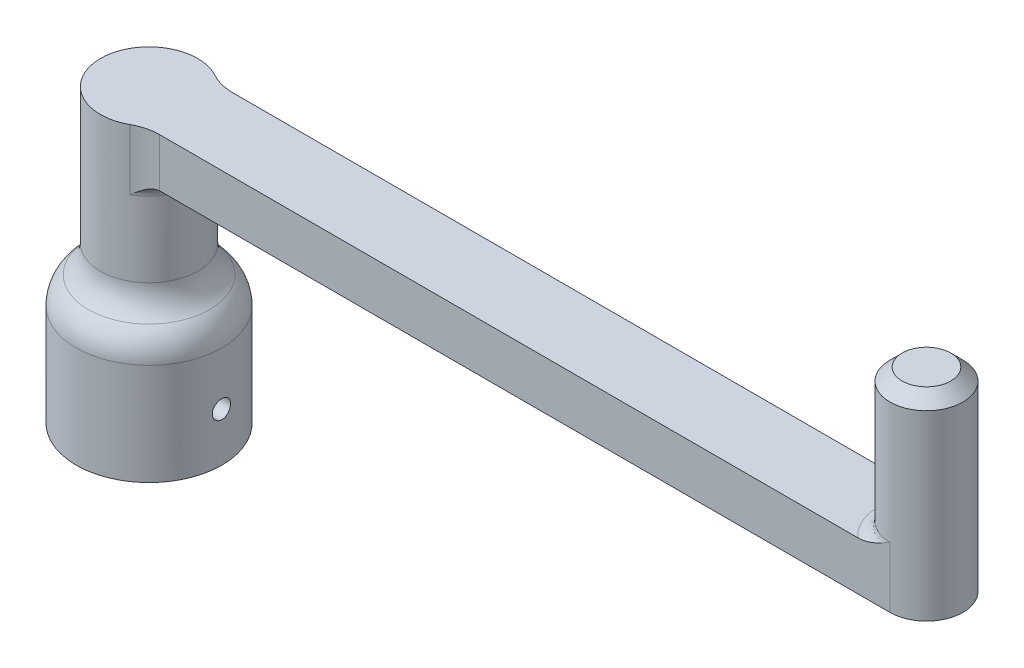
ISO-10303-21;
HEADER;
FILE_DESCRIPTION(('STEP AP214'),'2;1');
FILE_NAME('part.step','',(''),(''),'','','');
FILE_SCHEMA(('AUTOMOTIVE_DESIGN { 1 0 10303 214 1 1 1 1 }'));
ENDSEC;
DATA;
#1=APPLICATION_CONTEXT('core data for automotive mechanical design processes');
#2=APPLICATION_PROTOCOL_DEFINITION('international standard','automotive_design',2000,#1);
#3=PRODUCT_CONTEXT('',#1,'mechanical');
#4=PRODUCT('Part','Part','',(#3));
#5=PRODUCT_RELATED_PRODUCT_CATEGORY('part','',(#4));
#6=PRODUCT_DEFINITION_FORMATION('','',#4);
#7=PRODUCT_DEFINITION_CONTEXT('part definition',#1,'design');
#8=PRODUCT_DEFINITION('design','',#6,#7);
#9=PRODUCT_DEFINITION_SHAPE('','',#8);
#10=(LENGTH_UNIT() NAMED_UNIT(*) SI_UNIT(.MILLI.,.METRE.));
#11=(NAMED_UNIT(*) PLANE_ANGLE_UNIT() SI_UNIT($,.RADIAN.));
#12=(NAMED_UNIT(*) SI_UNIT($,.STERADIAN.) SOLID_ANGLE_UNIT());
#13=UNCERTAINTY_MEASURE_WITH_UNIT(LENGTH_MEASURE(1.E-05),#10,'distance_accuracy_value','');
#14=(GEOMETRIC_REPRESENTATION_CONTEXT(3) GLOBAL_UNCERTAINTY_ASSIGNED_CONTEXT((#13)) GLOBAL_UNIT_ASSIGNED_CONTEXT((#10,
#11,#12)) REPRESENTATION_CONTEXT('',''));
#15=CARTESIAN_POINT('',(0.,0.,0.));
#16=DIRECTION('',(0.,0.,1.));
#17=DIRECTION('',(1.,0.,0.));
#18=AXIS2_PLACEMENT_3D('',#15,#16,#17);
#19=CARTESIAN_POINT('',(0.,38.1,0.));
#20=DIRECTION('',(0.,-1.,0.));
#21=DIRECTION('',(0.,0.,-1.));
#22=AXIS2_PLACEMENT_3D('',#19,#20,#21);
#23=CYLINDRICAL_SURFACE('',#22,6.35);
#24=CARTESIAN_POINT('',(0.,20.3651280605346,0.));
#25=DIRECTION('',(0.,-1.,0.));
#26=DIRECTION('',(0.,0.,-1.));
#27=AXIS2_PLACEMENT_3D('',#24,#25,#26);
#28=CIRCLE('',#27,6.35);
#29=CARTESIAN_POINT('',(0.,20.3651280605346,-6.35));
#30=VERTEX_POINT('',#29);
#31=EDGE_CURVE('E314',#30,#30,#28,.F.);
#32=ORIENTED_EDGE('',*,*,#31,.T.);
#33=EDGE_LOOP('',(#32));
#34=FACE_BOUND('',#33,.T.);
#35=DIRECTION('',(0.,-1.,0.));
#36=VECTOR('',#35,1.);
#37=CARTESIAN_POINT('',(3.07418053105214,38.1,-5.55625));
#38=LINE('',#37,#36);
#39=CARTESIAN_POINT('',(3.07418053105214,38.1,-5.55625));
#40=VERTEX_POINT('',#39);
#41=CARTESIAN_POINT('',(3.07418053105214,30.1625,-5.55625));
#42=VERTEX_POINT('',#41);
#43=EDGE_CURVE('E305',#40,#42,#38,.T.);
#44=ORIENTED_EDGE('',*,*,#43,.T.);
#45=CARTESIAN_POINT('',(0.,30.1625,0.));
#46=DIRECTION('',(0.,1.,0.));
#47=DIRECTION('',(0.,0.,1.));
#48=AXIS2_PLACEMENT_3D('',#45,#46,#47);
#49=CIRCLE('',#48,6.35);
#50=CARTESIAN_POINT('',(3.07418053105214,30.1625,5.55625));
#51=VERTEX_POINT('',#50);
#52=EDGE_CURVE('E277',#42,#51,#49,.F.);
#53=ORIENTED_EDGE('',*,*,#52,.T.);
#54=DIRECTION('',(0.,-1.,0.));
#55=VECTOR('',#54,1.);
#56=CARTESIAN_POINT('',(3.07418053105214,38.1,5.55625));
#57=LINE('',#56,#55);
#58=CARTESIAN_POINT('',(3.07418053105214,38.1,5.55625));
#59=VERTEX_POINT('',#58);
#60=EDGE_CURVE('E303',#51,#59,#57,.F.);
#61=ORIENTED_EDGE('',*,*,#60,.T.);
#62=CARTESIAN_POINT('',(0.,38.1,0.));
#63=DIRECTION('',(0.,1.,0.));
#64=DIRECTION('',(0.,0.,1.));
#65=AXIS2_PLACEMENT_3D('',#62,#63,#64);
#66=CIRCLE('',#65,6.35);
#67=EDGE_CURVE('E316',#40,#59,#66,.T.);
#68=ORIENTED_EDGE('',*,*,#67,.F.);
#69=EDGE_LOOP('',(#44,#53,#61,#68));
#70=FACE_BOUND('',#69,.T.);
#71=ADVANCED_FACE('F34',(#34,#70),#23,.T.);
#72=CARTESIAN_POINT('',(0.,0.,0.));
#73=DIRECTION('',(0.,1.,0.));
#74=DIRECTION('',(0.,0.,1.));
#75=AXIS2_PLACEMENT_3D('',#72,#73,#74);
#76=PLANE('',#75);
#77=CARTESIAN_POINT('',(0.,0.,0.));
#78=DIRECTION('',(0.,1.,0.));
#79=DIRECTION('',(0.,0.,1.));
#80=AXIS2_PLACEMENT_3D('',#77,#78,#79);
#81=CIRCLE('',#80,9.525);
#82=CARTESIAN_POINT('',(0.,0.,9.525));
#83=VERTEX_POINT('',#82);
#84=EDGE_CURVE('E318',#83,#83,#81,.T.);
#85=ORIENTED_EDGE('',*,*,#84,.F.);
#86=EDGE_LOOP('',(#85));
#87=FACE_BOUND('',#86,.T.);
#88=CARTESIAN_POINT('',(0.,0.,0.));
#89=DIRECTION('',(0.,1.,0.));
#90=DIRECTION('',(0.,0.,1.));
#91=AXIS2_PLACEMENT_3D('',#88,#89,#90);
#92=CIRCLE('',#91,6.35);
#93=CARTESIAN_POINT('',(4.7625,0.,-4.20013020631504));
#94=VERTEX_POINT('',#93);
#95=CARTESIAN_POINT('',(4.7625,0.,4.20013020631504));
#96=VERTEX_POINT('',#95);
#97=EDGE_CURVE('E158',#94,#96,#92,.T.);
#98=ORIENTED_EDGE('',*,*,#97,.T.);
#99=DIRECTION('',(0.,0.,-1.));
#100=VECTOR('',#99,1.);
#101=CARTESIAN_POINT('',(4.7625,0.,4.20013020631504));
#102=LINE('',#101,#100);
#103=EDGE_CURVE('E328',#96,#94,#102,.T.);
#104=ORIENTED_EDGE('',*,*,#103,.T.);
#105=EDGE_LOOP('',(#98,#104));
#106=FACE_BOUND('',#105,.T.);
#107=ADVANCED_FACE('F191',(#87,#106),#76,.F.);
#108=CARTESIAN_POINT('',(0.,38.1,0.));
#109=DIRECTION('',(0.,1.,0.));
#110=DIRECTION('',(0.,0.,1.));
#111=AXIS2_PLACEMENT_3D('',#108,#109,#110);
#112=PLANE('',#111);
#113=DIRECTION('',(1.,0.,0.));
#114=VECTOR('',#113,1.);
#115=CARTESIAN_POINT('',(0.,38.1,4.7625));
#116=LINE('',#115,#114);
#117=CARTESIAN_POINT('',(6.14836106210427,38.1,4.7625));
#118=VERTEX_POINT('',#117);
#119=CARTESIAN_POINT('',(97.3998697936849,38.1,4.76250000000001));
#120=VERTEX_POINT('',#119);
#121=EDGE_CURVE('E128',#118,#120,#116,.T.);
#122=ORIENTED_EDGE('',*,*,#121,.T.);
#123=CARTESIAN_POINT('',(101.6,38.1,0.));
#124=DIRECTION('',(0.,1.,0.));
#125=DIRECTION('',(0.,0.,1.));
#126=AXIS2_PLACEMENT_3D('',#123,#124,#125);
#127=CIRCLE('',#126,6.35);
#128=CARTESIAN_POINT('',(97.3998697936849,38.1,-4.76249999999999));
#129=VERTEX_POINT('',#128);
#130=EDGE_CURVE('E275',#120,#129,#127,.F.);
#131=ORIENTED_EDGE('',*,*,#130,.T.);
#132=DIRECTION('',(1.,0.,0.));
#133=VECTOR('',#132,1.);
#134=CARTESIAN_POINT('',(0.,38.1,-4.7625));
#135=LINE('',#134,#133);
#136=CARTESIAN_POINT('',(6.14836106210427,38.1,-4.7625));
#137=VERTEX_POINT('',#136);
#138=EDGE_CURVE('E289',#137,#129,#135,.T.);
#139=ORIENTED_EDGE('',*,*,#138,.F.);
#140=CARTESIAN_POINT('',(6.14836106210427,38.1,-11.1125));
#141=DIRECTION('',(0.,1.,0.));
#142=DIRECTION('',(0.,0.,1.));
#143=AXIS2_PLACEMENT_3D('',#140,#141,#142);
#144=CIRCLE('',#143,6.35);
#145=EDGE_CURVE('E265',#137,#40,#144,.F.);
#146=ORIENTED_EDGE('',*,*,#145,.T.);
#147=ORIENTED_EDGE('',*,*,#67,.T.);
#148=CARTESIAN_POINT('',(6.14836106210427,38.1,11.1125));
#149=DIRECTION('',(0.,1.,0.));
#150=DIRECTION('',(0.,0.,1.));
#151=AXIS2_PLACEMENT_3D('',#148,#149,#150);
#152=CIRCLE('',#151,6.35);
#153=EDGE_CURVE('E269',#59,#118,#152,.F.);
#154=ORIENTED_EDGE('',*,*,#153,.T.);
#155=EDGE_LOOP('',(#122,#131,#139,#146,#147,#154));
#156=FACE_BOUND('',#155,.T.);
#157=ADVANCED_FACE('F188',(#156),#112,.T.);
#158=CARTESIAN_POINT('',(0.,15.875,0.));
#159=DIRECTION('',(0.,-1.,0.));
#160=DIRECTION('',(0.,0.,-1.));
#161=AXIS2_PLACEMENT_3D('',#158,#159,#160);
#162=CYLINDRICAL_SURFACE('',#161,9.525);
#163=CARTESIAN_POINT('',(9.525,5.159375,0.));
#164=CARTESIAN_POINT('',(9.52499907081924,5.15937782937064,0.0665993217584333));
#165=CARTESIAN_POINT('',(9.52429412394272,5.16498183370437,0.133240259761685));
#166=CARTESIAN_POINT('',(9.52154975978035,5.18724884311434,0.264667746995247));
#167=CARTESIAN_POINT('',(9.51950894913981,5.20392339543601,0.32945228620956));
#168=CARTESIAN_POINT('',(9.51432276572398,5.24783255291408,0.455245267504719));
#169=CARTESIAN_POINT('',(9.51117813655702,5.27506005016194,0.5162562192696));
#170=CARTESIAN_POINT('',(9.50413406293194,5.33928666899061,0.63283122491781));
#171=CARTESIAN_POINT('',(9.5002347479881,5.37628411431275,0.688396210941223));
#172=CARTESIAN_POINT('',(9.49209265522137,5.4592181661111,0.792819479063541));
#173=CARTESIAN_POINT('',(9.48784828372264,5.50519780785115,0.841643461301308));
#174=CARTESIAN_POINT('',(9.47950729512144,5.60469866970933,0.930903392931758));
#175=CARTESIAN_POINT('',(9.47541068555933,5.65822027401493,0.971338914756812));
#176=CARTESIAN_POINT('',(9.46781335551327,5.77150863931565,1.04280183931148));
#177=CARTESIAN_POINT('',(9.4643146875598,5.83129581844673,1.07379711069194));
#178=CARTESIAN_POINT('',(9.45833037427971,5.95527783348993,1.1252944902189));
#179=CARTESIAN_POINT('',(9.45584469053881,6.01947250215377,1.14579699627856));
#180=CARTESIAN_POINT('',(9.45218299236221,6.1500912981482,1.1756226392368));
#181=CARTESIAN_POINT('',(9.45100019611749,6.21650200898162,1.18500368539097));
#182=CARTESIAN_POINT('',(9.45005743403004,6.34996488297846,1.19249930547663));
#183=CARTESIAN_POINT('',(9.45029741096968,6.41701702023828,1.1906143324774));
#184=CARTESIAN_POINT('',(9.45216687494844,6.54945579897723,1.17567895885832));
#185=CARTESIAN_POINT('',(9.45378842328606,6.61484976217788,1.16269234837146));
#186=CARTESIAN_POINT('',(9.45822593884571,6.74252287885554,1.12602186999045));
#187=CARTESIAN_POINT('',(9.46104193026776,6.80480196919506,1.10233778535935));
#188=CARTESIAN_POINT('',(9.4675600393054,6.92467563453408,1.04487609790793));
#189=CARTESIAN_POINT('',(9.4712645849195,6.98225678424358,1.01107077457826));
#190=CARTESIAN_POINT('',(9.47914051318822,7.09095293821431,0.93434604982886));
#191=CARTESIAN_POINT('',(9.48331191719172,7.14206764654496,0.891426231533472));
#192=CARTESIAN_POINT('',(9.49168683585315,7.23675021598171,0.79733732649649));
#193=CARTESIAN_POINT('',(9.49589037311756,7.28026345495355,0.746113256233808));
#194=CARTESIAN_POINT('',(9.50382893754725,7.35808260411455,0.637059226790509));
#195=CARTESIAN_POINT('',(9.50756396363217,7.39238849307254,0.57922925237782));
#196=CARTESIAN_POINT('',(9.51414698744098,7.45081916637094,0.458562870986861));
#197=CARTESIAN_POINT('',(9.51699468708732,7.47494053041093,0.39572479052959));
#198=CARTESIAN_POINT('',(9.52147949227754,7.51227407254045,0.266846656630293));
#199=CARTESIAN_POINT('',(9.52311665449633,7.52548676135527,0.200806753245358));
#200=CARTESIAN_POINT('',(9.52498855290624,7.54055709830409,0.0678718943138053));
#201=CARTESIAN_POINT('',(9.5252325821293,7.54248999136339,0.000985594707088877));
#202=CARTESIAN_POINT('',(9.52431580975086,7.53514444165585,-0.13215748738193));
#203=CARTESIAN_POINT('',(9.52315503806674,7.52586623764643,-0.198414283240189));
#204=CARTESIAN_POINT('',(9.51956488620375,7.4964243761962,-0.328195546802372));
#205=CARTESIAN_POINT('',(9.51713968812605,7.4762965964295,-0.391728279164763));
#206=CARTESIAN_POINT('',(9.51129220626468,7.42576423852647,-0.514516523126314));
#207=CARTESIAN_POINT('',(9.50786988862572,7.39535931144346,-0.573771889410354));
#208=CARTESIAN_POINT('',(9.50038655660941,7.32495369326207,-0.686659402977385));
#209=CARTESIAN_POINT('',(9.49632233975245,7.28490432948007,-0.740260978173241));
#210=CARTESIAN_POINT('',(9.48801986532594,7.19641555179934,-0.840008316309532));
#211=CARTESIAN_POINT('',(9.4837816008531,7.14797580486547,-0.886153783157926));
#212=CARTESIAN_POINT('',(9.47558003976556,7.04374984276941,-0.969945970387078));
#213=CARTESIAN_POINT('',(9.47161844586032,6.98792337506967,-1.00754281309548));
#214=CARTESIAN_POINT('',(9.46444677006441,6.87070401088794,-1.07282593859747));
#215=CARTESIAN_POINT('',(9.46123667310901,6.80931122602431,-1.10051242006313));
#216=CARTESIAN_POINT('',(9.45594303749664,6.68286287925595,-1.14510815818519));
#217=CARTESIAN_POINT('',(9.45385656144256,6.61781736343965,-1.16204553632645));
#218=CARTESIAN_POINT('',(9.45103797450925,6.48577769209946,-1.18475283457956));
#219=CARTESIAN_POINT('',(9.4503058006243,6.41878362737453,-1.19052327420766));
#220=CARTESIAN_POINT('',(9.45028055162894,6.28524479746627,-1.1907233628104));
#221=CARTESIAN_POINT('',(9.45097753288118,6.21870013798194,-1.18523137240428));
#222=CARTESIAN_POINT('',(9.45371068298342,6.08748760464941,-1.16322843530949));
#223=CARTESIAN_POINT('',(9.45574685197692,6.02281973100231,-1.14671748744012));
#224=CARTESIAN_POINT('',(9.46092587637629,5.89720676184,-1.1031698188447));
#225=CARTESIAN_POINT('',(9.46406833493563,5.83626034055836,-1.07613687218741));
#226=CARTESIAN_POINT('',(9.47110651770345,5.71975615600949,-1.01232028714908));
#227=CARTESIAN_POINT('',(9.47500225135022,5.66419846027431,-0.97553652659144));
#228=CARTESIAN_POINT('',(9.48314050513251,5.5596482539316,-0.892971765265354));
#229=CARTESIAN_POINT('',(9.48738516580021,5.51070202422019,-0.847132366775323));
#230=CARTESIAN_POINT('',(9.49572411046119,5.42116637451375,-0.747879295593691));
#231=CARTESIAN_POINT('',(9.49981835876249,5.38057892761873,-0.69446383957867));
#232=CARTESIAN_POINT('',(9.50741235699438,5.3087815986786,-0.581342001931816));
#233=CARTESIAN_POINT('',(9.51090978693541,5.27760796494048,-0.521612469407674));
#234=CARTESIAN_POINT('',(9.5168925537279,5.22577794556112,-0.397755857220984));
#235=CARTESIAN_POINT('',(9.5193789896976,5.20511013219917,-0.333633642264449));
#236=CARTESIAN_POINT('',(9.52246025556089,5.17982549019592,-0.224316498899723));
#237=CARTESIAN_POINT('',(9.5234080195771,5.17216757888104,-0.179810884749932));
#238=CARTESIAN_POINT('',(9.52467820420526,5.1619413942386,-0.0902098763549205));
#239=CARTESIAN_POINT('',(9.52500062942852,5.15937308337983,-0.0451144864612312));
#240=CARTESIAN_POINT('',(9.525,5.159375,0.));
#241=B_SPLINE_CURVE_WITH_KNOTS('',3,(#163,#164,#165,#166,#167,#168,#169,#170,#171,#172,#173,
#174,#175,#176,#177,#178,#179,#180,#181,#182,#183,#184,#185,#186,#187,#188,#189,#190,#191,#192,
#193,#194,#195,#196,#197,#198,#199,#200,#201,#202,#203,#204,#205,#206,#207,#208,#209,#210,#211,
#212,#213,#214,#215,#216,#217,#218,#219,#220,#221,#222,#223,#224,#225,#226,#227,#228,#229,#230,
#231,#232,#233,#234,#235,#236,#237,#238,#239,#240),.UNSPECIFIED.,.T.,.F.,(4,2,2,2,2,2,2,2,2,2,2,
2,2,2,2,2,2,2,2,2,2,2,2,2,2,2,2,2,2,2,2,2,2,2,2,2,2,2,4),(0.,0.199633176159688,
0.399474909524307,0.599182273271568,0.798855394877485,0.999509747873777,1.20017432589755,
1.40151445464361,1.60284694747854,1.8031264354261,2.00339786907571,2.20252621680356,
2.40165859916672,2.60134144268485,2.8010334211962,3.00210606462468,3.2031791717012,
3.40431975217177,3.60545091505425,3.80523883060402,4.00502249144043,4.2041495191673,
4.40328330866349,4.60344394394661,4.80361252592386,5.00492063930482,5.20622471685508,
5.4069999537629,5.60776584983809,5.80713961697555,6.00651340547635,6.20581574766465,
6.40512058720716,6.60575531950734,6.80643735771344,7.00788255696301,7.20910816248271,
7.34434099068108,7.47957282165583),.UNSPECIFIED.);
#242=CARTESIAN_POINT('',(9.525,5.159375,0.));
#243=VERTEX_POINT('',#242);
#244=EDGE_CURVE('E150',#243,#243,#241,.T.);
#245=ORIENTED_EDGE('',*,*,#244,.T.);
#246=EDGE_LOOP('',(#245));
#247=FACE_BOUND('',#246,.T.);
#248=CARTESIAN_POINT('',(0.,13.2656122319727,0.));
#249=DIRECTION('',(0.,-1.,0.));
#250=DIRECTION('',(0.,0.,-1.));
#251=AXIS2_PLACEMENT_3D('',#248,#249,#250);
#252=CIRCLE('',#251,9.525);
#253=CARTESIAN_POINT('',(0.,13.2656122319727,-9.525));
#254=VERTEX_POINT('',#253);
#255=EDGE_CURVE('E307',#254,#254,#252,.T.);
#256=ORIENTED_EDGE('',*,*,#255,.T.);
#257=EDGE_LOOP('',(#256));
#258=FACE_BOUND('',#257,.T.);
#259=ORIENTED_EDGE('',*,*,#84,.T.);
#260=EDGE_LOOP('',(#259));
#261=FACE_BOUND('',#260,.T.);
#262=ADVANCED_FACE('F161',(#247,#258,#261),#162,.T.);
#263=CARTESIAN_POINT('',(0.,12.7,0.));
#264=DIRECTION('',(0.,-1.,0.));
#265=DIRECTION('',(0.,0.,-1.));
#266=AXIS2_PLACEMENT_3D('',#263,#264,#265);
#267=CYLINDRICAL_SURFACE('',#266,6.35);
#268=ORIENTED_EDGE('',*,*,#97,.F.);
#269=DIRECTION('',(0.,-1.,0.));
#270=VECTOR('',#269,1.);
#271=CARTESIAN_POINT('',(4.7625,12.7,-4.20013020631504));
#272=LINE('',#271,#270);
#273=CARTESIAN_POINT('',(4.7625,12.7,-4.20013020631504));
#274=VERTEX_POINT('',#273);
#275=EDGE_CURVE('E324',#274,#94,#272,.T.);
#276=ORIENTED_EDGE('',*,*,#275,.F.);
#277=CARTESIAN_POINT('',(0.,12.7,0.));
#278=DIRECTION('',(0.,1.,0.));
#279=DIRECTION('',(0.,0.,1.));
#280=AXIS2_PLACEMENT_3D('',#277,#278,#279);
#281=CIRCLE('',#280,6.35);
#282=CARTESIAN_POINT('',(4.7625,12.7,4.20013020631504));
#283=VERTEX_POINT('',#282);
#284=EDGE_CURVE('E159',#274,#283,#281,.T.);
#285=ORIENTED_EDGE('',*,*,#284,.T.);
#286=DIRECTION('',(0.,-1.,0.));
#287=VECTOR('',#286,1.);
#288=CARTESIAN_POINT('',(4.7625,12.7,4.20013020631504));
#289=LINE('',#288,#287);
#290=EDGE_CURVE('E321',#283,#96,#289,.T.);
#291=ORIENTED_EDGE('',*,*,#290,.T.);
#292=EDGE_LOOP('',(#268,#276,#285,#291));
#293=FACE_BOUND('',#292,.T.);
#294=ADVANCED_FACE('F181',(#293),#267,.F.);
#295=CARTESIAN_POINT('',(4.7625,12.7,4.20013020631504));
#296=DIRECTION('',(-1.,0.,0.));
#297=DIRECTION('',(0.,0.,1.));
#298=AXIS2_PLACEMENT_3D('',#295,#296,#297);
#299=PLANE('',#298);
#300=CARTESIAN_POINT('',(4.7625,6.35,0.));
#301=DIRECTION('',(-1.,0.,0.));
#302=DIRECTION('',(0.,0.,1.));
#303=AXIS2_PLACEMENT_3D('',#300,#301,#302);
#304=CIRCLE('',#303,1.190625);
#305=CARTESIAN_POINT('',(4.7625,6.35,1.190625));
#306=VERTEX_POINT('',#305);
#307=EDGE_CURVE('E139',#306,#306,#304,.T.);
#308=ORIENTED_EDGE('',*,*,#307,.F.);
#309=EDGE_LOOP('',(#308));
#310=FACE_BOUND('',#309,.T.);
#311=ORIENTED_EDGE('',*,*,#103,.F.);
#312=ORIENTED_EDGE('',*,*,#290,.F.);
#313=DIRECTION('',(0.,0.,-1.));
#314=VECTOR('',#313,1.);
#315=CARTESIAN_POINT('',(4.7625,12.7,4.20013020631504));
#316=LINE('',#315,#314);
#317=EDGE_CURVE('E327',#283,#274,#316,.T.);
#318=ORIENTED_EDGE('',*,*,#317,.T.);
#319=ORIENTED_EDGE('',*,*,#275,.T.);
#320=EDGE_LOOP('',(#311,#312,#318,#319));
#321=FACE_BOUND('',#320,.T.);
#322=ADVANCED_FACE('F178',(#310,#321),#299,.T.);
#323=CARTESIAN_POINT('',(0.,12.7,0.));
#324=DIRECTION('',(0.,1.,0.));
#325=DIRECTION('',(0.,0.,1.));
#326=AXIS2_PLACEMENT_3D('',#323,#324,#325);
#327=PLANE('',#326);
#328=ORIENTED_EDGE('',*,*,#284,.F.);
#329=ORIENTED_EDGE('',*,*,#317,.F.);
#330=EDGE_LOOP('',(#328,#329));
#331=FACE_BOUND('',#330,.T.);
#332=ADVANCED_FACE('F174',(#331),#327,.F.);
#333=CARTESIAN_POINT('',(0.,20.3651280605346,0.));
#334=DIRECTION('',(0.,-1.,0.));
#335=DIRECTION('',(0.,0.,-1.));
#336=AXIS2_PLACEMENT_3D('',#333,#334,#335);
#337=TOROIDAL_SURFACE('',#336,11.1125,4.7625);
#338=CARTESIAN_POINT('',(0.,16.8153701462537,0.));
#339=DIRECTION('',(0.,1.,0.));
#340=DIRECTION('',(0.,0.,1.));
#341=AXIS2_PLACEMENT_3D('',#338,#339,#340);
#342=CIRCLE('',#341,7.93749999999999);
#343=CARTESIAN_POINT('',(0.,16.8153701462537,7.93749999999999));
#344=VERTEX_POINT('',#343);
#345=EDGE_CURVE('E311',#344,#344,#342,.T.);
#346=ORIENTED_EDGE('',*,*,#345,.T.);
#347=EDGE_LOOP('',(#346));
#348=FACE_BOUND('',#347,.T.);
#349=ORIENTED_EDGE('',*,*,#31,.F.);
#350=EDGE_LOOP('',(#349));
#351=FACE_BOUND('',#350,.T.);
#352=ADVANCED_FACE('F177',(#348,#351),#337,.F.);
#353=CARTESIAN_POINT('',(0.,13.2656122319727,0.));
#354=DIRECTION('',(0.,-1.,0.));
#355=DIRECTION('',(0.,0.,-1.));
#356=AXIS2_PLACEMENT_3D('',#353,#354,#355);
#357=DEGENERATE_TOROIDAL_SURFACE('',#356,4.7625,4.7625,.T.);
#358=ORIENTED_EDGE('',*,*,#255,.F.);
#359=EDGE_LOOP('',(#358));
#360=FACE_BOUND('',#359,.T.);
#361=ORIENTED_EDGE('',*,*,#345,.F.);
#362=EDGE_LOOP('',(#361));
#363=FACE_BOUND('',#362,.T.);
#364=ADVANCED_FACE('F170',(#360,#363),#357,.T.);
#365=CARTESIAN_POINT('',(9.525,6.35,0.));
#366=DIRECTION('',(-1.,0.,0.));
#367=DIRECTION('',(0.,0.,1.));
#368=AXIS2_PLACEMENT_3D('',#365,#366,#367);
#369=CYLINDRICAL_SURFACE('',#368,1.190625);
#370=ORIENTED_EDGE('',*,*,#307,.T.);
#371=EDGE_LOOP('',(#370));
#372=FACE_BOUND('',#371,.T.);
#373=ORIENTED_EDGE('',*,*,#244,.F.);
#374=EDGE_LOOP('',(#373));
#375=FACE_BOUND('',#374,.T.);
#376=ADVANCED_FACE('F165',(#372,#375),#369,.F.);
#377=CARTESIAN_POINT('',(101.6,31.75,0.));
#378=DIRECTION('',(0.,1.,0.));
#379=DIRECTION('',(0.,0.,1.));
#380=AXIS2_PLACEMENT_3D('',#377,#378,#379);
#381=PLANE('',#380);
#382=DIRECTION('',(1.,0.,0.));
#383=VECTOR('',#382,1.);
#384=CARTESIAN_POINT('',(0.,31.75,4.7625));
#385=LINE('',#384,#383);
#386=CARTESIAN_POINT('',(6.35,31.75,4.7625));
#387=VERTEX_POINT('',#386);
#388=CARTESIAN_POINT('',(101.6,31.75,4.76250000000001));
#389=VERTEX_POINT('',#388);
#390=EDGE_CURVE('E144',#387,#389,#385,.T.);
#391=ORIENTED_EDGE('',*,*,#390,.F.);
#392=CARTESIAN_POINT('',(0.,31.75,0.));
#393=DIRECTION('',(0.,1.,0.));
#394=DIRECTION('',(0.,0.,1.));
#395=AXIS2_PLACEMENT_3D('',#392,#393,#394);
#396=CIRCLE('',#395,7.9375);
#397=CARTESIAN_POINT('',(6.35,31.75,-4.7625));
#398=VERTEX_POINT('',#397);
#399=EDGE_CURVE('E126',#387,#398,#396,.T.);
#400=ORIENTED_EDGE('',*,*,#399,.T.);
#401=DIRECTION('',(1.,0.,0.));
#402=VECTOR('',#401,1.);
#403=CARTESIAN_POINT('',(0.,31.75,-4.7625));
#404=LINE('',#403,#402);
#405=CARTESIAN_POINT('',(101.6,31.75,-4.76249999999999));
#406=VERTEX_POINT('',#405);
#407=EDGE_CURVE('E119',#398,#406,#404,.T.);
#408=ORIENTED_EDGE('',*,*,#407,.T.);
#409=CARTESIAN_POINT('',(101.6,31.75,0.));
#410=DIRECTION('',(0.,1.,0.));
#411=DIRECTION('',(0.,0.,1.));
#412=AXIS2_PLACEMENT_3D('',#409,#410,#411);
#413=CIRCLE('',#412,4.7625);
#414=EDGE_CURVE('E124',#389,#406,#413,.T.);
#415=ORIENTED_EDGE('',*,*,#414,.F.);
#416=EDGE_LOOP('',(#391,#400,#408,#415));
#417=FACE_BOUND('',#416,.T.);
#418=ADVANCED_FACE('F122',(#417),#381,.F.);
#419=CARTESIAN_POINT('',(0.,31.75,-4.7625));
#420=DIRECTION('',(0.,0.,1.));
#421=DIRECTION('',(1.,0.,0.));
#422=AXIS2_PLACEMENT_3D('',#419,#420,#421);
#423=PLANE('',#422);
#424=ORIENTED_EDGE('',*,*,#407,.F.);
#425=CARTESIAN_POINT('',(6.35,31.75,-4.7625));
#426=CARTESIAN_POINT('',(6.31633922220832,31.7499923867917,-4.7625));
#427=CARTESIAN_POINT('',(6.28270554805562,31.7493118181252,-4.7625));
#428=CARTESIAN_POINT('',(6.21549256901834,31.7466047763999,-4.7625));
#429=CARTESIAN_POINT('',(6.18191326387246,31.7445783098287,-4.7625));
#430=CARTESIAN_POINT('',(6.14836106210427,31.7418788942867,-4.7625));
#431=B_SPLINE_CURVE_WITH_KNOTS('',3,(#425,#426,#427,#428,#429,#430),.UNSPECIFIED.,.F.,.F.,(4,2,
4),(0.,0.100921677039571,0.201842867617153),.UNSPECIFIED.);
#432=CARTESIAN_POINT('',(6.14836106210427,31.7418788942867,-4.7625));
#433=VERTEX_POINT('',#432);
#434=EDGE_CURVE('E227',#398,#433,#431,.T.);
#435=ORIENTED_EDGE('',*,*,#434,.T.);
#436=DIRECTION('',(0.,1.,0.));
#437=VECTOR('',#436,1.);
#438=CARTESIAN_POINT('',(6.14836106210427,38.1,-4.7625));
#439=LINE('',#438,#437);
#440=EDGE_CURVE('E62',#433,#137,#439,.T.);
#441=ORIENTED_EDGE('',*,*,#440,.T.);
#442=ORIENTED_EDGE('',*,*,#138,.T.);
#443=CARTESIAN_POINT('',(97.3998697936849,38.1,-4.76249999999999));
#444=CARTESIAN_POINT('',(97.5198682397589,38.1000308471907,-4.76249999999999));
#445=CARTESIAN_POINT('',(97.6397037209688,38.1059456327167,-4.76249999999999));
#446=CARTESIAN_POINT('',(97.8781900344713,38.1280174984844,-4.76249999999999));
#447=CARTESIAN_POINT('',(97.9968428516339,38.1441526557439,-4.76249999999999));
#448=CARTESIAN_POINT('',(98.3470869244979,38.2050568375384,-4.76249999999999));
#449=CARTESIAN_POINT('',(98.576478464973,38.2624166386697,-4.76249999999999));
#450=CARTESIAN_POINT('',(99.0479939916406,38.4080180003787,-4.76249999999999));
#451=CARTESIAN_POINT('',(99.2893534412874,38.498611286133,-4.76249999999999));
#452=CARTESIAN_POINT('',(99.7637324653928,38.6997063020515,-4.76249999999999));
#453=CARTESIAN_POINT('',(99.9967420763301,38.8102309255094,-4.76249999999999));
#454=CARTESIAN_POINT('',(100.689162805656,39.1616631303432,-4.76249999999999));
#455=CARTESIAN_POINT('',(101.138805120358,39.4212293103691,-4.76249999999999));
#456=CARTESIAN_POINT('',(101.592031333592,39.6828993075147,-4.76249999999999));
#457=CARTESIAN_POINT('',(101.596015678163,39.6851996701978,-4.76249999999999));
#458=CARTESIAN_POINT('',(101.6,39.6875,-4.76249999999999));
#459=B_SPLINE_CURVE_WITH_KNOTS('',3,(#443,#444,#445,#446,#447,#448,#449,#450,#451,#452,#453,
#454,#455,#456,#457,#458),.UNSPECIFIED.,.F.,.F.,(4,2,2,2,2,2,2,4),(0.,0.359606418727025,
0.718444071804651,1.42568925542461,2.19786526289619,2.97093391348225,4.52714090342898,
4.54094307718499),.UNSPECIFIED.);
#460=CARTESIAN_POINT('',(101.6,39.6875,-4.76249999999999));
#461=VERTEX_POINT('',#460);
#462=EDGE_CURVE('E135',#129,#461,#459,.T.);
#463=ORIENTED_EDGE('',*,*,#462,.T.);
#464=DIRECTION('',(0.,1.,0.));
#465=VECTOR('',#464,1.);
#466=CARTESIAN_POINT('',(101.6,31.75,-4.76249999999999));
#467=LINE('',#466,#465);
#468=EDGE_CURVE('E131',#406,#461,#467,.T.);
#469=ORIENTED_EDGE('',*,*,#468,.F.);
#470=EDGE_LOOP('',(#424,#435,#441,#442,#463,#469));
#471=FACE_BOUND('',#470,.T.);
#472=ADVANCED_FACE('F132',(#471),#423,.F.);
#473=CARTESIAN_POINT('',(0.,31.75,4.7625));
#474=DIRECTION('',(0.,0.,1.));
#475=DIRECTION('',(1.,0.,0.));
#476=AXIS2_PLACEMENT_3D('',#473,#474,#475);
#477=PLANE('',#476);
#478=ORIENTED_EDGE('',*,*,#121,.F.);
#479=DIRECTION('',(0.,-1.,0.));
#480=VECTOR('',#479,1.);
#481=CARTESIAN_POINT('',(6.14836106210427,31.75,4.7625));
#482=LINE('',#481,#480);
#483=CARTESIAN_POINT('',(6.14836106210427,31.7418788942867,4.7625));
#484=VERTEX_POINT('',#483);
#485=EDGE_CURVE('E54',#118,#484,#482,.T.);
#486=ORIENTED_EDGE('',*,*,#485,.T.);
#487=CARTESIAN_POINT('',(6.14836106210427,31.7418788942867,4.7625));
#488=CARTESIAN_POINT('',(6.18191326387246,31.7445783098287,4.7625));
#489=CARTESIAN_POINT('',(6.21549256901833,31.7466047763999,4.7625));
#490=CARTESIAN_POINT('',(6.28270554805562,31.7493118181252,4.7625));
#491=CARTESIAN_POINT('',(6.31633922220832,31.7499923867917,4.7625));
#492=CARTESIAN_POINT('',(6.35,31.75,4.7625));
#493=B_SPLINE_CURVE_WITH_KNOTS('',3,(#487,#488,#489,#490,#491,#492),.UNSPECIFIED.,.F.,.F.,(4,2,
4),(0.,0.100921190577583,0.201842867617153),.UNSPECIFIED.);
#494=EDGE_CURVE('E11',#484,#387,#493,.T.);
#495=ORIENTED_EDGE('',*,*,#494,.T.);
#496=ORIENTED_EDGE('',*,*,#390,.T.);
#497=DIRECTION('',(0.,1.,0.));
#498=VECTOR('',#497,1.);
#499=CARTESIAN_POINT('',(101.6,31.75,4.76250000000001));
#500=LINE('',#499,#498);
#501=CARTESIAN_POINT('',(101.6,39.6875,4.76250000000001));
#502=VERTEX_POINT('',#501);
#503=EDGE_CURVE('E140',#389,#502,#500,.T.);
#504=ORIENTED_EDGE('',*,*,#503,.T.);
#505=CARTESIAN_POINT('',(97.3998697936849,38.1,4.76250000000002));
#506=CARTESIAN_POINT('',(97.5198682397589,38.1000308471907,4.76250000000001));
#507=CARTESIAN_POINT('',(97.6397037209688,38.1059456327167,4.76250000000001));
#508=CARTESIAN_POINT('',(97.8781900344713,38.1280174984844,4.76250000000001));
#509=CARTESIAN_POINT('',(97.9968428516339,38.1441526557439,4.76250000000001));
#510=CARTESIAN_POINT('',(98.3470869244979,38.2050568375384,4.76250000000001));
#511=CARTESIAN_POINT('',(98.576478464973,38.2624166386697,4.76250000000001));
#512=CARTESIAN_POINT('',(99.0479939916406,38.4080180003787,4.76250000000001));
#513=CARTESIAN_POINT('',(99.2893534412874,38.498611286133,4.76250000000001));
#514=CARTESIAN_POINT('',(99.7637324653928,38.6997063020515,4.76250000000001));
#515=CARTESIAN_POINT('',(99.9967420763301,38.8102309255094,4.76250000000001));
#516=CARTESIAN_POINT('',(100.689162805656,39.1616631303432,4.76250000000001));
#517=CARTESIAN_POINT('',(101.138805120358,39.4212293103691,4.76250000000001));
#518=CARTESIAN_POINT('',(101.592031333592,39.6828993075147,4.76250000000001));
#519=CARTESIAN_POINT('',(101.596015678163,39.6851996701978,4.76250000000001));
#520=CARTESIAN_POINT('',(101.6,39.6875,4.76250000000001));
#521=B_SPLINE_CURVE_WITH_KNOTS('',3,(#505,#506,#507,#508,#509,#510,#511,#512,#513,#514,#515,
#516,#517,#518,#519,#520),.UNSPECIFIED.,.F.,.F.,(4,2,2,2,2,2,2,4),(0.,0.359606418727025,
0.718444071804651,1.42568925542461,2.19786526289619,2.97093391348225,4.52714090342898,
4.54094307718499),.UNSPECIFIED.);
#522=EDGE_CURVE('E238',#502,#120,#521,.F.);
#523=ORIENTED_EDGE('',*,*,#522,.T.);
#524=EDGE_LOOP('',(#478,#486,#495,#496,#504,#523));
#525=FACE_BOUND('',#524,.T.);
#526=ADVANCED_FACE('F284',(#525),#477,.T.);
#527=CARTESIAN_POINT('',(101.6,31.75,0.));
#528=DIRECTION('',(0.,1.,0.));
#529=DIRECTION('',(0.,0.,1.));
#530=AXIS2_PLACEMENT_3D('',#527,#528,#529);
#531=CYLINDRICAL_SURFACE('',#530,4.7625);
#532=CARTESIAN_POINT('',(101.6,55.5625,0.));
#533=DIRECTION('',(0.,1.,0.));
#534=DIRECTION('',(0.,0.,1.));
#535=AXIS2_PLACEMENT_3D('',#532,#533,#534);
#536=CIRCLE('',#535,4.7625);
#537=CARTESIAN_POINT('',(101.6,55.5625,4.76250000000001));
#538=VERTEX_POINT('',#537);
#539=EDGE_CURVE('E261',#538,#538,#536,.F.);
#540=ORIENTED_EDGE('',*,*,#539,.T.);
#541=EDGE_LOOP('',(#540));
#542=FACE_BOUND('',#541,.T.);
#543=CARTESIAN_POINT('',(101.6,39.6875,0.));
#544=DIRECTION('',(0.,1.,0.));
#545=DIRECTION('',(0.,0.,1.));
#546=AXIS2_PLACEMENT_3D('',#543,#544,#545);
#547=CIRCLE('',#546,4.7625);
#548=EDGE_CURVE('E267',#461,#502,#547,.T.);
#549=ORIENTED_EDGE('',*,*,#548,.T.);
#550=ORIENTED_EDGE('',*,*,#503,.F.);
#551=ORIENTED_EDGE('',*,*,#414,.T.);
#552=ORIENTED_EDGE('',*,*,#468,.T.);
#553=EDGE_LOOP('',(#549,#550,#551,#552));
#554=FACE_BOUND('',#553,.T.);
#555=ADVANCED_FACE('F143',(#542,#554),#531,.T.);
#556=CARTESIAN_POINT('',(6.14836106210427,38.1,11.1125));
#557=DIRECTION('',(0.,-1.,0.));
#558=DIRECTION('',(0.,0.,-1.));
#559=AXIS2_PLACEMENT_3D('',#556,#557,#558);
#560=CYLINDRICAL_SURFACE('',#559,6.35);
#561=ORIENTED_EDGE('',*,*,#60,.F.);
#562=CARTESIAN_POINT('',(6.14836106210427,31.7418788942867,4.7625));
#563=CARTESIAN_POINT('',(6.06599127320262,31.7352568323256,4.76249222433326));
#564=CARTESIAN_POINT('',(5.98404470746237,31.7247721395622,4.76410280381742));
#565=CARTESIAN_POINT('',(5.82158872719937,31.6970939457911,4.77039554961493));
#566=CARTESIAN_POINT('',(5.74107649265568,31.6799156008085,4.77507079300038));
#567=CARTESIAN_POINT('',(5.50389853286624,31.6202565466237,4.79331381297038));
#568=CARTESIAN_POINT('',(5.34963530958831,31.5694478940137,4.81110707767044));
#569=CARTESIAN_POINT('',(5.07308687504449,31.4612130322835,4.85289426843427));
#570=CARTESIAN_POINT('',(4.94961633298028,31.4061225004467,4.87545298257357));
#571=CARTESIAN_POINT('',(4.70811260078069,31.2874384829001,4.92675687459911));
#572=CARTESIAN_POINT('',(4.59008252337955,31.223840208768,4.95550554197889));
#573=CARTESIAN_POINT('',(4.35847466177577,31.0900275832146,5.01878867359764));
#574=CARTESIAN_POINT('',(4.24492918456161,31.0197744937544,5.05335805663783));
#575=CARTESIAN_POINT('',(4.02256210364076,30.8748412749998,5.12775142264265));
#576=CARTESIAN_POINT('',(3.91373918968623,30.8001623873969,5.16757393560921));
#577=CARTESIAN_POINT('',(3.68090721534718,30.6341020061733,5.25992975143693));
#578=CARTESIAN_POINT('',(3.55770968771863,30.54214179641,5.31345942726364));
#579=CARTESIAN_POINT('',(3.31641603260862,30.3564550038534,5.42740158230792));
#580=CARTESIAN_POINT('',(3.1983091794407,30.2627327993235,5.48779850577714));
#581=CARTESIAN_POINT('',(3.07954911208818,30.1668375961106,5.55328220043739));
#582=CARTESIAN_POINT('',(3.07686427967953,30.1646687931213,5.55476513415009));
#583=CARTESIAN_POINT('',(3.07418053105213,30.1625,5.55625));
#584=B_SPLINE_CURVE_WITH_KNOTS('',3,(#562,#563,#564,#565,#566,#567,#568,#569,#570,#571,#572,
#573,#574,#575,#576,#577,#578,#579,#580,#581,#582,#583),.UNSPECIFIED.,.F.,.F.,(4,2,2,2,2,2,2,2,
2,2,4),(0.,0.24762508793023,0.49469272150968,0.983002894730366,1.39369335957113,
1.80461595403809,2.21809777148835,2.63146412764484,3.11956566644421,3.60658278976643,
3.61785221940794),.UNSPECIFIED.);
#585=EDGE_CURVE('E48',#51,#484,#584,.F.);
#586=ORIENTED_EDGE('',*,*,#585,.T.);
#587=ORIENTED_EDGE('',*,*,#485,.F.);
#588=ORIENTED_EDGE('',*,*,#153,.F.);
#589=EDGE_LOOP('',(#561,#586,#587,#588));
#590=FACE_BOUND('',#589,.T.);
#591=ADVANCED_FACE('F208',(#590),#560,.F.);
#592=CARTESIAN_POINT('',(6.14836106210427,38.1,-11.1125));
#593=DIRECTION('',(0.,-1.,0.));
#594=DIRECTION('',(0.,0.,-1.));
#595=AXIS2_PLACEMENT_3D('',#592,#593,#594);
#596=CYLINDRICAL_SURFACE('',#595,6.35);
#597=ORIENTED_EDGE('',*,*,#440,.F.);
#598=CARTESIAN_POINT('',(6.14836106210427,31.7418788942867,-4.7625));
#599=CARTESIAN_POINT('',(6.06599127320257,31.7352568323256,-4.76249222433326));
#600=CARTESIAN_POINT('',(5.98404470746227,31.7247721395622,-4.76410280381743));
#601=CARTESIAN_POINT('',(5.82158872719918,31.6970939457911,-4.77039554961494));
#602=CARTESIAN_POINT('',(5.74107649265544,31.6799156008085,-4.7750707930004));
#603=CARTESIAN_POINT('',(5.50389853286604,31.6202565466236,-4.79331381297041));
#604=CARTESIAN_POINT('',(5.34963530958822,31.5694478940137,-4.81110707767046));
#605=CARTESIAN_POINT('',(5.07308687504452,31.4612130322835,-4.85289426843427));
#606=CARTESIAN_POINT('',(4.94961633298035,31.4061225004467,-4.87545298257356));
#607=CARTESIAN_POINT('',(4.70811260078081,31.2874384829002,-4.92675687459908));
#608=CARTESIAN_POINT('',(4.5900825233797,31.2238402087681,-4.95550554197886));
#609=CARTESIAN_POINT('',(4.35847466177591,31.0900275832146,-5.0187886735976));
#610=CARTESIAN_POINT('',(4.24492918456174,31.0197744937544,-5.05335805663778));
#611=CARTESIAN_POINT('',(4.02256210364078,30.8748412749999,-5.12775142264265));
#612=CARTESIAN_POINT('',(3.91373918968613,30.8001623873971,-5.16757393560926));
#613=CARTESIAN_POINT('',(3.6809072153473,30.6341020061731,-5.25992975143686));
#614=CARTESIAN_POINT('',(3.55770968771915,30.5421417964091,-5.31345942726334));
#615=CARTESIAN_POINT('',(3.31641603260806,30.3564550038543,-5.42740158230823));
#616=CARTESIAN_POINT('',(3.19830917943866,30.2627327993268,-5.48779850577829));
#617=CARTESIAN_POINT('',(3.07954911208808,30.1668375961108,-5.55328220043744));
#618=CARTESIAN_POINT('',(3.07686427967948,30.1646687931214,-5.55476513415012));
#619=CARTESIAN_POINT('',(3.07418053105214,30.1625,-5.55625));
#620=B_SPLINE_CURVE_WITH_KNOTS('',3,(#598,#599,#600,#601,#602,#603,#604,#605,#606,#607,#608,
#609,#610,#611,#612,#613,#614,#615,#616,#617,#618,#619),.UNSPECIFIED.,.F.,.F.,(4,2,2,2,2,2,2,2,
2,2,4),(0.,0.247625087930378,0.494692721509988,0.983002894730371,1.39369335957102,
1.80461595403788,2.21809777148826,2.63146412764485,3.11956566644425,3.60658278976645,
3.61785221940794),.UNSPECIFIED.);
#621=EDGE_CURVE('E221',#433,#42,#620,.T.);
#622=ORIENTED_EDGE('',*,*,#621,.T.);
#623=ORIENTED_EDGE('',*,*,#43,.F.);
#624=ORIENTED_EDGE('',*,*,#145,.F.);
#625=EDGE_LOOP('',(#597,#622,#623,#624));
#626=FACE_BOUND('',#625,.T.);
#627=ADVANCED_FACE('F212',(#626),#596,.F.);
#628=CARTESIAN_POINT('',(101.6,57.15,0.));
#629=DIRECTION('',(0.,1.,0.));
#630=DIRECTION('',(0.,0.,1.));
#631=AXIS2_PLACEMENT_3D('',#628,#629,#630);
#632=PLANE('',#631);
#633=CARTESIAN_POINT('',(101.6,57.15,0.));
#634=DIRECTION('',(0.,1.,0.));
#635=DIRECTION('',(0.,0.,1.));
#636=AXIS2_PLACEMENT_3D('',#633,#634,#635);
#637=CIRCLE('',#636,3.17499999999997);
#638=CARTESIAN_POINT('',(101.6,57.15,3.17499999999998));
#639=VERTEX_POINT('',#638);
#640=EDGE_CURVE('E264',#639,#639,#637,.T.);
#641=ORIENTED_EDGE('',*,*,#640,.T.);
#642=EDGE_LOOP('',(#641));
#643=FACE_BOUND('',#642,.T.);
#644=ADVANCED_FACE('F251',(#643),#632,.T.);
#645=CARTESIAN_POINT('',(101.6,57.15,0.));
#646=DIRECTION('',(0.,-1.,0.));
#647=DIRECTION('',(0.,0.,-1.));
#648=AXIS2_PLACEMENT_3D('',#645,#646,#647);
#649=CONICAL_SURFACE('',#648,3.17499999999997,0.785398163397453);
#650=ORIENTED_EDGE('',*,*,#539,.F.);
#651=EDGE_LOOP('',(#650));
#652=FACE_BOUND('',#651,.T.);
#653=ORIENTED_EDGE('',*,*,#640,.F.);
#654=EDGE_LOOP('',(#653));
#655=FACE_BOUND('',#654,.T.);
#656=ADVANCED_FACE('F247',(#652,#655),#649,.T.);
#657=CARTESIAN_POINT('',(101.6,39.6875,0.));
#658=DIRECTION('',(0.,1.,0.));
#659=DIRECTION('',(0.,0.,1.));
#660=AXIS2_PLACEMENT_3D('',#657,#658,#659);
#661=TOROIDAL_SURFACE('',#660,6.35,1.5875);
#662=ORIENTED_EDGE('',*,*,#462,.F.);
#663=ORIENTED_EDGE('',*,*,#130,.F.);
#664=ORIENTED_EDGE('',*,*,#522,.F.);
#665=ORIENTED_EDGE('',*,*,#548,.F.);
#666=EDGE_LOOP('',(#662,#663,#664,#665));
#667=FACE_BOUND('',#666,.T.);
#668=ADVANCED_FACE('F244',(#667),#661,.F.);
#669=CARTESIAN_POINT('',(0.,30.1625,0.));
#670=DIRECTION('',(0.,1.,0.));
#671=DIRECTION('',(0.,0.,1.));
#672=AXIS2_PLACEMENT_3D('',#669,#670,#671);
#673=TOROIDAL_SURFACE('',#672,7.9375,1.5875);
#674=ORIENTED_EDGE('',*,*,#585,.F.);
#675=ORIENTED_EDGE('',*,*,#52,.F.);
#676=ORIENTED_EDGE('',*,*,#621,.F.);
#677=ORIENTED_EDGE('',*,*,#434,.F.);
#678=ORIENTED_EDGE('',*,*,#399,.F.);
#679=ORIENTED_EDGE('',*,*,#494,.F.);
#680=EDGE_LOOP('',(#674,#675,#676,#677,#678,#679));
#681=FACE_BOUND('',#680,.T.);
#682=ADVANCED_FACE('F36',(#681),#673,.F.);
#683=CLOSED_SHELL('',(#71,#107,#157,#262,#294,#322,#332,#352,#364,#376,#418,#472,#526,#555,#591,
#627,#644,#656,#668,#682));
#684=MANIFOLD_SOLID_BREP('B2',#683);
#685=ADVANCED_BREP_SHAPE_REPRESENTATION('',(#18,#684),#14);
#686=SHAPE_DEFINITION_REPRESENTATION(#9,#685);
ENDSEC;
END-ISO-10303-21;
